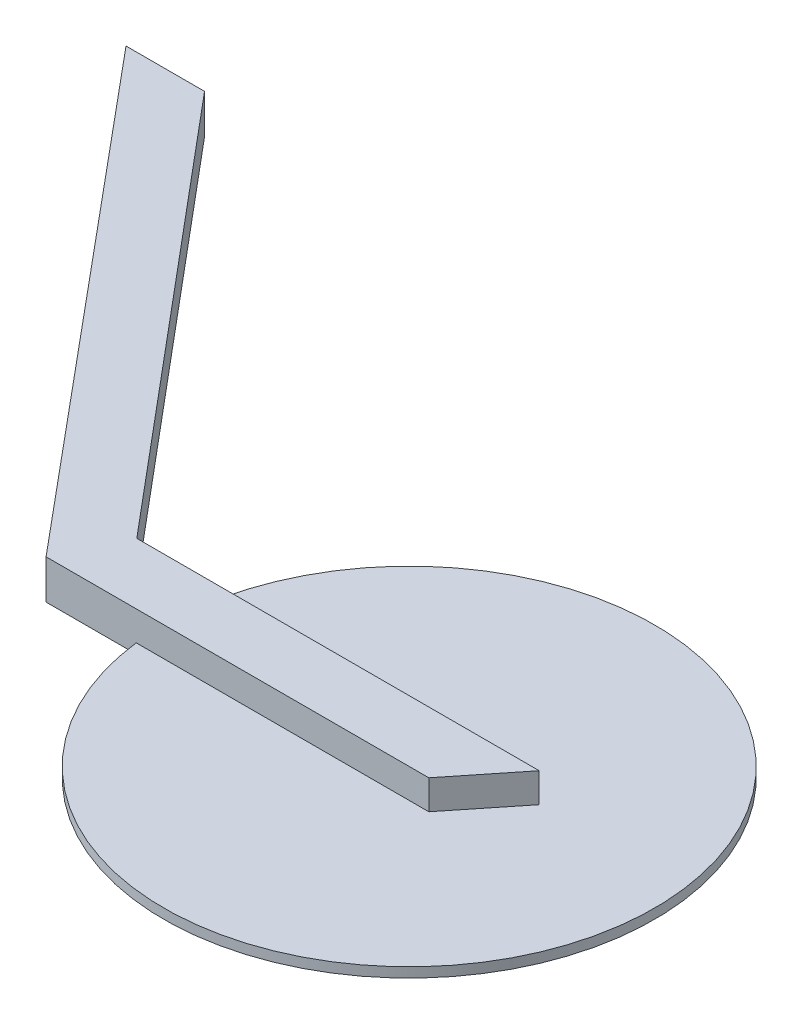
ISO-10303-21;
HEADER;
FILE_DESCRIPTION(('STEP AP214'),'2;1');
FILE_NAME('part.step','',(''),(''),'','','');
FILE_SCHEMA(('AUTOMOTIVE_DESIGN { 1 0 10303 214 1 1 1 1 }'));
ENDSEC;
DATA;
#1=APPLICATION_CONTEXT('core data for automotive mechanical design processes');
#2=APPLICATION_PROTOCOL_DEFINITION('international standard','automotive_design',2000,#1);
#3=PRODUCT_CONTEXT('',#1,'mechanical');
#4=PRODUCT('Part','Part','',(#3));
#5=PRODUCT_RELATED_PRODUCT_CATEGORY('part','',(#4));
#6=PRODUCT_DEFINITION_FORMATION('','',#4);
#7=PRODUCT_DEFINITION_CONTEXT('part definition',#1,'design');
#8=PRODUCT_DEFINITION('design','',#6,#7);
#9=PRODUCT_DEFINITION_SHAPE('','',#8);
#10=(LENGTH_UNIT() NAMED_UNIT(*) SI_UNIT(.MILLI.,.METRE.));
#11=(NAMED_UNIT(*) PLANE_ANGLE_UNIT() SI_UNIT($,.RADIAN.));
#12=(NAMED_UNIT(*) SI_UNIT($,.STERADIAN.) SOLID_ANGLE_UNIT());
#13=UNCERTAINTY_MEASURE_WITH_UNIT(LENGTH_MEASURE(1.E-05),#10,'distance_accuracy_value','');
#14=(GEOMETRIC_REPRESENTATION_CONTEXT(3) GLOBAL_UNCERTAINTY_ASSIGNED_CONTEXT((#13)) GLOBAL_UNIT_ASSIGNED_CONTEXT((#10,
#11,#12)) REPRESENTATION_CONTEXT('',''));
#15=CARTESIAN_POINT('',(0.,0.,0.));
#16=DIRECTION('',(0.,0.,1.));
#17=DIRECTION('',(1.,0.,0.));
#18=AXIS2_PLACEMENT_3D('',#15,#16,#17);
#19=CARTESIAN_POINT('',(84.9953382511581,4.,42.8975736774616));
#20=DIRECTION('',(0.780867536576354,0.,0.624696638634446));
#21=DIRECTION('',(0.624696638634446,0.,-0.780867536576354));
#22=AXIS2_PLACEMENT_3D('',#19,#20,#21);
#23=PLANE('',#22);
#24=DIRECTION('',(0.,-1.,0.));
#25=VECTOR('',#24,1.);
#26=CARTESIAN_POINT('',(79.9977651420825,4.,49.1445139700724));
#27=LINE('',#26,#25);
#28=CARTESIAN_POINT('',(79.9977651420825,4.,49.1445139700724));
#29=VERTEX_POINT('',#28);
#30=CARTESIAN_POINT('',(79.9977651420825,1.,49.1445139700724));
#31=VERTEX_POINT('',#30);
#32=EDGE_CURVE('E49',#29,#31,#27,.T.);
#33=ORIENTED_EDGE('',*,*,#32,.T.);
#34=DIRECTION('',(0.624696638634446,0.,-0.780867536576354));
#35=VECTOR('',#34,1.);
#36=CARTESIAN_POINT('',(84.9953382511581,1.,42.8975736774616));
#37=LINE('',#36,#35);
#38=CARTESIAN_POINT('',(84.9953382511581,1.,42.8975736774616));
#39=VERTEX_POINT('',#38);
#40=EDGE_CURVE('E188',#31,#39,#37,.T.);
#41=ORIENTED_EDGE('',*,*,#40,.T.);
#42=DIRECTION('',(0.,-1.,0.));
#43=VECTOR('',#42,1.);
#44=CARTESIAN_POINT('',(84.9953382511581,4.,42.8975736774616));
#45=LINE('',#44,#43);
#46=CARTESIAN_POINT('',(84.9953382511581,4.,42.8975736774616));
#47=VERTEX_POINT('',#46);
#48=EDGE_CURVE('E111',#47,#39,#45,.T.);
#49=ORIENTED_EDGE('',*,*,#48,.F.);
#50=DIRECTION('',(-0.624696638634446,0.,0.780867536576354));
#51=VECTOR('',#50,1.);
#52=CARTESIAN_POINT('',(84.9953382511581,4.,42.8975736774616));
#53=LINE('',#52,#51);
#54=EDGE_CURVE('E119',#47,#29,#53,.T.);
#55=ORIENTED_EDGE('',*,*,#54,.T.);
#56=EDGE_LOOP('',(#33,#41,#49,#55));
#57=FACE_BOUND('',#56,.T.);
#58=ADVANCED_FACE('F39',(#57),#23,.T.);
#59=CARTESIAN_POINT('',(79.9977651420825,4.,49.1445139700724));
#60=DIRECTION('',(0.,0.,1.));
#61=DIRECTION('',(1.,0.,0.));
#62=AXIS2_PLACEMENT_3D('',#59,#60,#61);
#63=PLANE('',#62);
#64=DIRECTION('',(0.,-1.,0.));
#65=VECTOR('',#64,1.);
#66=CARTESIAN_POINT('',(50.1806527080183,1.,49.1445139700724));
#67=LINE('',#66,#65);
#68=CARTESIAN_POINT('',(50.1806527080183,1.,49.1445139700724));
#69=VERTEX_POINT('',#68);
#70=CARTESIAN_POINT('',(50.1806527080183,0.,49.1445139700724));
#71=VERTEX_POINT('',#70);
#72=EDGE_CURVE('E185',#69,#71,#67,.T.);
#73=ORIENTED_EDGE('',*,*,#72,.F.);
#74=DIRECTION('',(1.,0.,0.));
#75=VECTOR('',#74,1.);
#76=CARTESIAN_POINT('',(79.9977651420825,1.,49.1445139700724));
#77=LINE('',#76,#75);
#78=EDGE_CURVE('E137',#69,#31,#77,.T.);
#79=ORIENTED_EDGE('',*,*,#78,.T.);
#80=ORIENTED_EDGE('',*,*,#32,.F.);
#81=DIRECTION('',(-1.,0.,0.));
#82=VECTOR('',#81,1.);
#83=CARTESIAN_POINT('',(79.9977651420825,4.,49.1445139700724));
#84=LINE('',#83,#82);
#85=CARTESIAN_POINT('',(40.9977651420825,4.,49.1445139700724));
#86=VERTEX_POINT('',#85);
#87=EDGE_CURVE('E150',#29,#86,#84,.T.);
#88=ORIENTED_EDGE('',*,*,#87,.T.);
#89=DIRECTION('',(0.,-1.,0.));
#90=VECTOR('',#89,1.);
#91=CARTESIAN_POINT('',(40.9977651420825,4.,49.1445139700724));
#92=LINE('',#91,#90);
#93=CARTESIAN_POINT('',(40.9977651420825,0.,49.1445139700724));
#94=VERTEX_POINT('',#93);
#95=EDGE_CURVE('E91',#86,#94,#92,.T.);
#96=ORIENTED_EDGE('',*,*,#95,.T.);
#97=DIRECTION('',(-1.,0.,0.));
#98=VECTOR('',#97,1.);
#99=CARTESIAN_POINT('',(79.9977651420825,0.,49.1445139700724));
#100=LINE('',#99,#98);
#101=EDGE_CURVE('E133',#71,#94,#100,.T.);
#102=ORIENTED_EDGE('',*,*,#101,.F.);
#103=EDGE_LOOP('',(#73,#79,#80,#88,#96,#102));
#104=FACE_BOUND('',#103,.T.);
#105=ADVANCED_FACE('F41',(#104),#63,.T.);
#106=CARTESIAN_POINT('',(43.9953382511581,4.,42.8975736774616));
#107=DIRECTION('',(0.,0.,-1.));
#108=DIRECTION('',(-1.,0.,0.));
#109=AXIS2_PLACEMENT_3D('',#106,#107,#108);
#110=PLANE('',#109);
#111=DIRECTION('',(0.,-1.,0.));
#112=VECTOR('',#111,1.);
#113=CARTESIAN_POINT('',(50.2117491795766,1.,42.8975736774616));
#114=LINE('',#113,#112);
#115=CARTESIAN_POINT('',(50.2117491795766,0.,42.8975736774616));
#116=VERTEX_POINT('',#115);
#117=CARTESIAN_POINT('',(50.2117491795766,1.,42.8975736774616));
#118=VERTEX_POINT('',#117);
#119=EDGE_CURVE('E180',#116,#118,#114,.F.);
#120=ORIENTED_EDGE('',*,*,#119,.F.);
#121=DIRECTION('',(1.,0.,0.));
#122=VECTOR('',#121,1.);
#123=CARTESIAN_POINT('',(43.9953382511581,0.,42.8975736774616));
#124=LINE('',#123,#122);
#125=CARTESIAN_POINT('',(43.9953382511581,0.,42.8975736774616));
#126=VERTEX_POINT('',#125);
#127=EDGE_CURVE('E108',#126,#116,#124,.T.);
#128=ORIENTED_EDGE('',*,*,#127,.F.);
#129=DIRECTION('',(0.,-1.,0.));
#130=VECTOR('',#129,1.);
#131=CARTESIAN_POINT('',(43.9953382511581,4.,42.8975736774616));
#132=LINE('',#131,#130);
#133=CARTESIAN_POINT('',(43.9953382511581,4.,42.8975736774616));
#134=VERTEX_POINT('',#133);
#135=EDGE_CURVE('E82',#134,#126,#132,.T.);
#136=ORIENTED_EDGE('',*,*,#135,.F.);
#137=DIRECTION('',(1.,0.,0.));
#138=VECTOR('',#137,1.);
#139=CARTESIAN_POINT('',(43.9953382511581,4.,42.8975736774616));
#140=LINE('',#139,#138);
#141=EDGE_CURVE('E105',#134,#47,#140,.T.);
#142=ORIENTED_EDGE('',*,*,#141,.T.);
#143=ORIENTED_EDGE('',*,*,#48,.T.);
#144=DIRECTION('',(-1.,0.,0.));
#145=VECTOR('',#144,1.);
#146=CARTESIAN_POINT('',(43.9953382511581,1.,42.8975736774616));
#147=LINE('',#146,#145);
#148=EDGE_CURVE('E11',#39,#118,#147,.T.);
#149=ORIENTED_EDGE('',*,*,#148,.T.);
#150=EDGE_LOOP('',(#120,#128,#136,#142,#143,#149));
#151=FACE_BOUND('',#150,.T.);
#152=ADVANCED_FACE('F103',(#151),#110,.T.);
#153=CARTESIAN_POINT('',(8.,4.,0.));
#154=DIRECTION('',(0.766044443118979,0.,-0.642787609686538));
#155=DIRECTION('',(-0.642787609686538,0.,-0.766044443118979));
#156=AXIS2_PLACEMENT_3D('',#153,#154,#155);
#157=PLANE('',#156);
#158=DIRECTION('',(0.642787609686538,0.,0.766044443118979));
#159=VECTOR('',#158,1.);
#160=CARTESIAN_POINT('',(8.,0.,0.));
#161=LINE('',#160,#159);
#162=CARTESIAN_POINT('',(8.,0.,0.));
#163=VERTEX_POINT('',#162);
#164=EDGE_CURVE('E145',#163,#126,#161,.T.);
#165=ORIENTED_EDGE('',*,*,#164,.F.);
#166=DIRECTION('',(0.,-1.,0.));
#167=VECTOR('',#166,1.);
#168=CARTESIAN_POINT('',(8.,4.,0.));
#169=LINE('',#168,#167);
#170=CARTESIAN_POINT('',(8.,4.,0.));
#171=VERTEX_POINT('',#170);
#172=EDGE_CURVE('E75',#171,#163,#169,.T.);
#173=ORIENTED_EDGE('',*,*,#172,.F.);
#174=DIRECTION('',(0.642787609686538,0.,0.766044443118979));
#175=VECTOR('',#174,1.);
#176=CARTESIAN_POINT('',(8.,4.,0.));
#177=LINE('',#176,#175);
#178=EDGE_CURVE('E117',#171,#134,#177,.T.);
#179=ORIENTED_EDGE('',*,*,#178,.T.);
#180=ORIENTED_EDGE('',*,*,#135,.T.);
#181=EDGE_LOOP('',(#165,#173,#179,#180));
#182=FACE_BOUND('',#181,.T.);
#183=ADVANCED_FACE('F122',(#182),#157,.T.);
#184=CARTESIAN_POINT('',(0.,4.,0.));
#185=DIRECTION('',(0.,0.,-1.));
#186=DIRECTION('',(-1.,0.,0.));
#187=AXIS2_PLACEMENT_3D('',#184,#185,#186);
#188=PLANE('',#187);
#189=DIRECTION('',(1.,0.,0.));
#190=VECTOR('',#189,1.);
#191=CARTESIAN_POINT('',(0.,0.,0.));
#192=LINE('',#191,#190);
#193=CARTESIAN_POINT('',(0.,0.,0.));
#194=VERTEX_POINT('',#193);
#195=EDGE_CURVE('E141',#194,#163,#192,.T.);
#196=ORIENTED_EDGE('',*,*,#195,.F.);
#197=DIRECTION('',(0.,-1.,0.));
#198=VECTOR('',#197,1.);
#199=CARTESIAN_POINT('',(0.,4.,0.));
#200=LINE('',#199,#198);
#201=CARTESIAN_POINT('',(0.,4.,0.));
#202=VERTEX_POINT('',#201);
#203=EDGE_CURVE('E157',#202,#194,#200,.T.);
#204=ORIENTED_EDGE('',*,*,#203,.F.);
#205=DIRECTION('',(1.,0.,0.));
#206=VECTOR('',#205,1.);
#207=CARTESIAN_POINT('',(0.,4.,0.));
#208=LINE('',#207,#206);
#209=EDGE_CURVE('E124',#202,#171,#208,.T.);
#210=ORIENTED_EDGE('',*,*,#209,.T.);
#211=ORIENTED_EDGE('',*,*,#172,.T.);
#212=EDGE_LOOP('',(#196,#204,#210,#211));
#213=FACE_BOUND('',#212,.T.);
#214=ADVANCED_FACE('F196',(#213),#188,.T.);
#215=CARTESIAN_POINT('',(40.9977651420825,4.,49.1445139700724));
#216=DIRECTION('',(-0.767883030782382,0.,0.640590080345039));
#217=DIRECTION('',(0.640590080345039,0.,0.767883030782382));
#218=AXIS2_PLACEMENT_3D('',#215,#216,#217);
#219=PLANE('',#218);
#220=DIRECTION('',(-0.640590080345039,0.,-0.767883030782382));
#221=VECTOR('',#220,1.);
#222=CARTESIAN_POINT('',(40.9977651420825,0.,49.1445139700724));
#223=LINE('',#222,#221);
#224=EDGE_CURVE('E136',#94,#194,#223,.T.);
#225=ORIENTED_EDGE('',*,*,#224,.F.);
#226=ORIENTED_EDGE('',*,*,#95,.F.);
#227=DIRECTION('',(-0.640590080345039,0.,-0.767883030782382));
#228=VECTOR('',#227,1.);
#229=CARTESIAN_POINT('',(40.9977651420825,4.,49.1445139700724));
#230=LINE('',#229,#228);
#231=EDGE_CURVE('E127',#86,#202,#230,.T.);
#232=ORIENTED_EDGE('',*,*,#231,.T.);
#233=ORIENTED_EDGE('',*,*,#203,.T.);
#234=EDGE_LOOP('',(#225,#226,#232,#233));
#235=FACE_BOUND('',#234,.T.);
#236=ADVANCED_FACE('F163',(#235),#219,.T.);
#237=CARTESIAN_POINT('',(0.,4.,0.));
#238=DIRECTION('',(0.,1.,0.));
#239=DIRECTION('',(0.,0.,1.));
#240=AXIS2_PLACEMENT_3D('',#237,#238,#239);
#241=PLANE('',#240);
#242=ORIENTED_EDGE('',*,*,#87,.F.);
#243=ORIENTED_EDGE('',*,*,#54,.F.);
#244=ORIENTED_EDGE('',*,*,#141,.F.);
#245=ORIENTED_EDGE('',*,*,#178,.F.);
#246=ORIENTED_EDGE('',*,*,#209,.F.);
#247=ORIENTED_EDGE('',*,*,#231,.F.);
#248=EDGE_LOOP('',(#242,#243,#244,#245,#246,#247));
#249=FACE_BOUND('',#248,.T.);
#250=ADVANCED_FACE('F115',(#249),#241,.T.);
#251=CARTESIAN_POINT('',(0.,0.,0.));
#252=DIRECTION('',(0.,1.,0.));
#253=DIRECTION('',(0.,0.,1.));
#254=AXIS2_PLACEMENT_3D('',#251,#252,#253);
#255=PLANE('',#254);
#256=CARTESIAN_POINT('',(75.,0.,46.1445139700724));
#257=DIRECTION('',(0.,-1.,0.));
#258=DIRECTION('',(0.,0.,-1.));
#259=AXIS2_PLACEMENT_3D('',#256,#257,#258);
#260=CIRCLE('',#259,25.);
#261=EDGE_CURVE('E168',#116,#71,#260,.T.);
#262=ORIENTED_EDGE('',*,*,#261,.T.);
#263=ORIENTED_EDGE('',*,*,#101,.T.);
#264=ORIENTED_EDGE('',*,*,#224,.T.);
#265=ORIENTED_EDGE('',*,*,#195,.T.);
#266=ORIENTED_EDGE('',*,*,#164,.T.);
#267=ORIENTED_EDGE('',*,*,#127,.T.);
#268=EDGE_LOOP('',(#262,#263,#264,#265,#266,#267));
#269=FACE_BOUND('',#268,.T.);
#270=ADVANCED_FACE('F166',(#269),#255,.F.);
#271=CARTESIAN_POINT('',(75.,1.,46.1445139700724));
#272=DIRECTION('',(0.,-1.,0.));
#273=DIRECTION('',(0.,0.,-1.));
#274=AXIS2_PLACEMENT_3D('',#271,#272,#273);
#275=CYLINDRICAL_SURFACE('',#274,25.);
#276=CARTESIAN_POINT('',(75.,1.,46.1445139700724));
#277=DIRECTION('',(0.,-1.,0.));
#278=DIRECTION('',(0.,0.,-1.));
#279=AXIS2_PLACEMENT_3D('',#276,#277,#278);
#280=CIRCLE('',#279,25.);
#281=EDGE_CURVE('E176',#118,#69,#280,.T.);
#282=ORIENTED_EDGE('',*,*,#281,.T.);
#283=ORIENTED_EDGE('',*,*,#72,.T.);
#284=ORIENTED_EDGE('',*,*,#261,.F.);
#285=ORIENTED_EDGE('',*,*,#119,.T.);
#286=EDGE_LOOP('',(#282,#283,#284,#285));
#287=FACE_BOUND('',#286,.T.);
#288=ADVANCED_FACE('F262',(#287),#275,.T.);
#289=CARTESIAN_POINT('',(75.,1.,46.1445139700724));
#290=DIRECTION('',(0.,-1.,0.));
#291=DIRECTION('',(0.,0.,-1.));
#292=AXIS2_PLACEMENT_3D('',#289,#290,#291);
#293=PLANE('',#292);
#294=ORIENTED_EDGE('',*,*,#78,.F.);
#295=ORIENTED_EDGE('',*,*,#281,.F.);
#296=ORIENTED_EDGE('',*,*,#148,.F.);
#297=ORIENTED_EDGE('',*,*,#40,.F.);
#298=EDGE_LOOP('',(#294,#295,#296,#297));
#299=FACE_BOUND('',#298,.T.);
#300=ADVANCED_FACE('F269',(#299),#293,.F.);
#301=CLOSED_SHELL('',(#58,#105,#152,#183,#214,#236,#250,#270,#288,#300));
#302=MANIFOLD_SOLID_BREP('B2',#301);
#303=ADVANCED_BREP_SHAPE_REPRESENTATION('',(#18,#302),#14);
#304=SHAPE_DEFINITION_REPRESENTATION(#9,#303);
ENDSEC;
END-ISO-10303-21;
